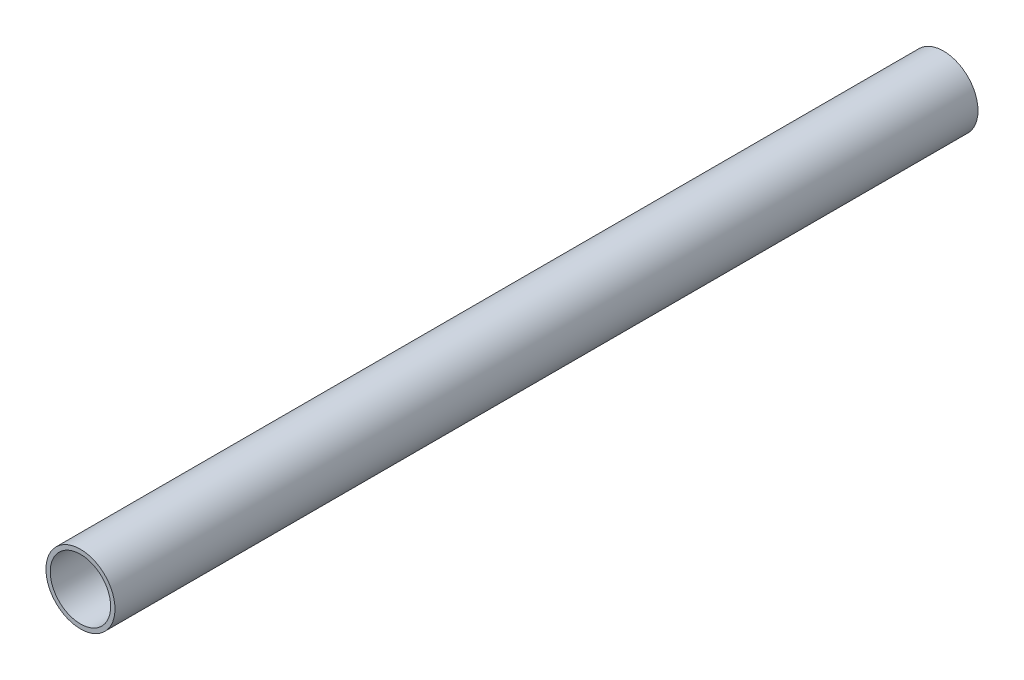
from build123d import *

# Parameters (mm, degrees)
SKETCH_1_R      = 8
SKETCH_1_R_2    = 7
EXTRUDE_1_DEPTH = 200


with BuildPart() as part:
    # Sketch 1 → Extrude 1 (new body)
    with BuildSketch(Plane.XY):
        Circle(SKETCH_1_R)
        Circle(SKETCH_1_R_2, mode=Mode.SUBTRACT)
    extrude(amount=EXTRUDE_1_DEPTH)


solid = part.part
